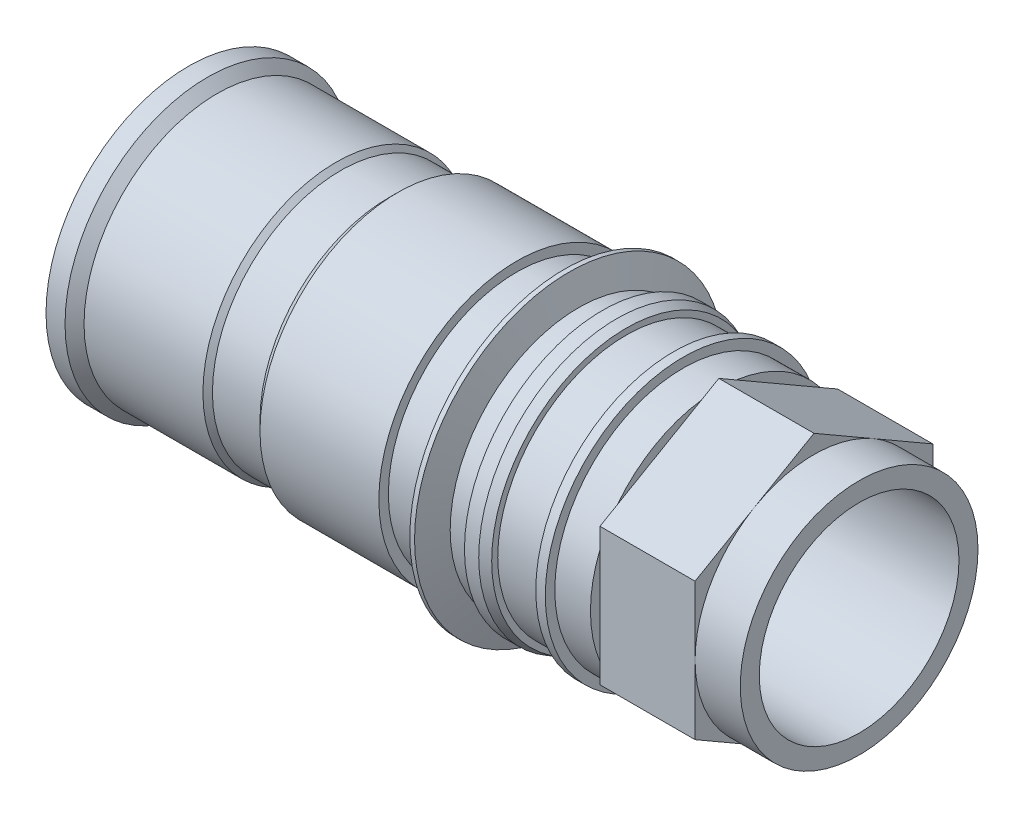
from build123d import *

# Parameters (mm, degrees)
SALIENTE_EXTRUIR1_DEPTH = 20
CROQUIS3_R              = 25
SALIENTE_EXTRUIR2_DEPTH = 9.5
CROQUIS4_R              = 21
CORTAR_EXTRUIR1_DEPTH   = 149.299845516


with BuildPart() as part:
    # Croquis1 → Revoluci_n1 (revolve)
    with BuildSketch(Plane.XY, mode=Mode.PRIVATE) as revoluci_n1_sk:
        Polygon((0, 0), (0, 30), (4, 30), (6, 28), (31, 28), (32, 27), (42, 27), (44, 29), (69, 29), (69, 27), (77, 27), (79, 32.494954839), (80, 32.494954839), (82, 27), (87, 27), (87, 29), (90, 29), (92, 28.272059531), (92, 27), (102, 27), (102, 29), (104, 29), (104, 27), (111.5, 27), (111.5, 0), align=None)
    revolve(revoluci_n1_sk.sketch.rotate(Axis((0, 0, 0), (1, 0, 0)), 90), axis=Axis((0, 0, 0), (1, 0, 0)))

    # Croquis2 → Saliente-Extruir1 (add)
    with BuildSketch(Plane(origin=(111.5, 0, 0), x_dir=(0, 0, -1), z_dir=(1, 0, 0))):
        Polygon((0, 28.867513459), (-25, 14.43375673), (-25, -14.43375673), (0, -28.867513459), (25, -14.43375673), (25, 14.43375673), align=None)
    extrude(amount=SALIENTE_EXTRUIR1_DEPTH)

    # Croquis3 → Saliente-Extruir2 (add)
    with BuildSketch(Plane(origin=(131.5, 0, 0), x_dir=(0, 0, -1), z_dir=(1, 0, 0))):
        Circle(CROQUIS3_R)
    extrude(amount=SALIENTE_EXTRUIR2_DEPTH)

    # Croquis4 → Cortar-Extruir1 (cut, through all)
    with BuildSketch(Plane(origin=(141, 0, 0), x_dir=(0, 0, -1), z_dir=(1, 0, 0))):
        Circle(CROQUIS4_R)
    extrude(amount=-CORTAR_EXTRUIR1_DEPTH, mode=Mode.SUBTRACT)


solid = part.part
